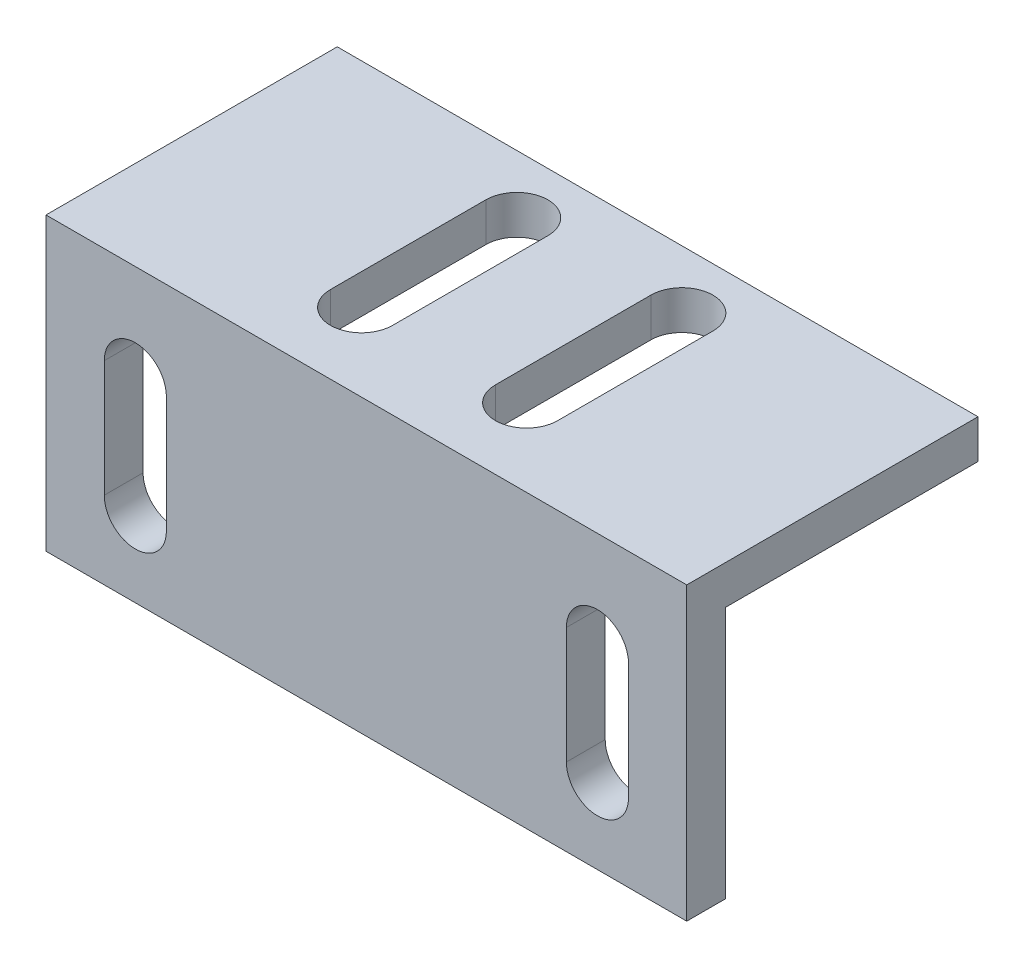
ISO-10303-21;
HEADER;
FILE_DESCRIPTION(('STEP AP214'),'2;1');
FILE_NAME('part.step','',(''),(''),'','','');
FILE_SCHEMA(('AUTOMOTIVE_DESIGN { 1 0 10303 214 1 1 1 1 }'));
ENDSEC;
DATA;
#1=APPLICATION_CONTEXT('core data for automotive mechanical design processes');
#2=APPLICATION_PROTOCOL_DEFINITION('international standard','automotive_design',2000,#1);
#3=PRODUCT_CONTEXT('',#1,'mechanical');
#4=PRODUCT('Part','Part','',(#3));
#5=PRODUCT_RELATED_PRODUCT_CATEGORY('part','',(#4));
#6=PRODUCT_DEFINITION_FORMATION('','',#4);
#7=PRODUCT_DEFINITION_CONTEXT('part definition',#1,'design');
#8=PRODUCT_DEFINITION('design','',#6,#7);
#9=PRODUCT_DEFINITION_SHAPE('','',#8);
#10=(LENGTH_UNIT() NAMED_UNIT(*) SI_UNIT(.MILLI.,.METRE.));
#11=(NAMED_UNIT(*) PLANE_ANGLE_UNIT() SI_UNIT($,.RADIAN.));
#12=(NAMED_UNIT(*) SI_UNIT($,.STERADIAN.) SOLID_ANGLE_UNIT());
#13=UNCERTAINTY_MEASURE_WITH_UNIT(LENGTH_MEASURE(1.E-05),#10,'distance_accuracy_value','');
#14=(GEOMETRIC_REPRESENTATION_CONTEXT(3) GLOBAL_UNCERTAINTY_ASSIGNED_CONTEXT((#13)) GLOBAL_UNIT_ASSIGNED_CONTEXT((#10,
#11,#12)) REPRESENTATION_CONTEXT('',''));
#15=CARTESIAN_POINT('',(0.,0.,0.));
#16=DIRECTION('',(0.,0.,1.));
#17=DIRECTION('',(1.,0.,0.));
#18=AXIS2_PLACEMENT_3D('',#15,#16,#17);
#19=CARTESIAN_POINT('',(33.,0.,-2.));
#20=DIRECTION('',(0.,1.,0.));
#21=DIRECTION('',(0.,0.,1.));
#22=AXIS2_PLACEMENT_3D('',#19,#20,#21);
#23=PLANE('',#22);
#24=DIRECTION('',(0.,0.,-1.));
#25=VECTOR('',#24,1.);
#26=CARTESIAN_POINT('',(0.,0.,-2.));
#27=LINE('',#26,#25);
#28=CARTESIAN_POINT('',(0.,0.,0.));
#29=VERTEX_POINT('',#28);
#30=CARTESIAN_POINT('',(0.,0.,-2.));
#31=VERTEX_POINT('',#30);
#32=EDGE_CURVE('E317',#29,#31,#27,.T.);
#33=ORIENTED_EDGE('',*,*,#32,.T.);
#34=DIRECTION('',(-1.,0.,0.));
#35=VECTOR('',#34,1.);
#36=CARTESIAN_POINT('',(33.,0.,-2.));
#37=LINE('',#36,#35);
#38=CARTESIAN_POINT('',(33.,0.,-2.));
#39=VERTEX_POINT('',#38);
#40=EDGE_CURVE('E11',#39,#31,#37,.T.);
#41=ORIENTED_EDGE('',*,*,#40,.F.);
#42=DIRECTION('',(0.,0.,-1.));
#43=VECTOR('',#42,1.);
#44=CARTESIAN_POINT('',(33.,0.,-2.));
#45=LINE('',#44,#43);
#46=CARTESIAN_POINT('',(33.,0.,0.));
#47=VERTEX_POINT('',#46);
#48=EDGE_CURVE('E318',#47,#39,#45,.T.);
#49=ORIENTED_EDGE('',*,*,#48,.F.);
#50=DIRECTION('',(-1.,0.,0.));
#51=VECTOR('',#50,1.);
#52=CARTESIAN_POINT('',(33.,0.,0.));
#53=LINE('',#52,#51);
#54=EDGE_CURVE('E332',#47,#29,#53,.T.);
#55=ORIENTED_EDGE('',*,*,#54,.T.);
#56=EDGE_LOOP('',(#33,#41,#49,#55));
#57=FACE_BOUND('',#56,.T.);
#58=ADVANCED_FACE('F36',(#57),#23,.F.);
#59=CARTESIAN_POINT('',(33.,13.,-2.));
#60=DIRECTION('',(0.,0.,1.));
#61=DIRECTION('',(0.,-1.,0.));
#62=AXIS2_PLACEMENT_3D('',#59,#60,#61);
#63=PLANE('',#62);
#64=DIRECTION('',(0.,1.,0.));
#65=VECTOR('',#64,1.);
#66=CARTESIAN_POINT('',(30.,13.,-2.));
#67=LINE('',#66,#65);
#68=CARTESIAN_POINT('',(30.,4.,-2.));
#69=VERTEX_POINT('',#68);
#70=CARTESIAN_POINT('',(30.,10.,-2.));
#71=VERTEX_POINT('',#70);
#72=EDGE_CURVE('E279',#69,#71,#67,.T.);
#73=ORIENTED_EDGE('',*,*,#72,.T.);
#74=CARTESIAN_POINT('',(28.4,10.,-2.));
#75=DIRECTION('',(0.,0.,1.));
#76=DIRECTION('',(0.,-1.,0.));
#77=AXIS2_PLACEMENT_3D('',#74,#75,#76);
#78=CIRCLE('',#77,1.6);
#79=CARTESIAN_POINT('',(26.8,10.,-2.));
#80=VERTEX_POINT('',#79);
#81=EDGE_CURVE('E282',#71,#80,#78,.T.);
#82=ORIENTED_EDGE('',*,*,#81,.T.);
#83=DIRECTION('',(0.,-1.,0.));
#84=VECTOR('',#83,1.);
#85=CARTESIAN_POINT('',(26.8,13.,-2.));
#86=LINE('',#85,#84);
#87=CARTESIAN_POINT('',(26.8,4.,-2.));
#88=VERTEX_POINT('',#87);
#89=EDGE_CURVE('E267',#80,#88,#86,.T.);
#90=ORIENTED_EDGE('',*,*,#89,.T.);
#91=CARTESIAN_POINT('',(28.4,4.,-2.));
#92=DIRECTION('',(0.,0.,1.));
#93=DIRECTION('',(0.,-1.,0.));
#94=AXIS2_PLACEMENT_3D('',#91,#92,#93);
#95=CIRCLE('',#94,1.6);
#96=EDGE_CURVE('E276',#88,#69,#95,.T.);
#97=ORIENTED_EDGE('',*,*,#96,.T.);
#98=EDGE_LOOP('',(#73,#82,#90,#97));
#99=FACE_BOUND('',#98,.T.);
#100=DIRECTION('',(0.,1.,0.));
#101=VECTOR('',#100,1.);
#102=CARTESIAN_POINT('',(6.2,13.,-2.));
#103=LINE('',#102,#101);
#104=CARTESIAN_POINT('',(6.2,4.,-2.));
#105=VERTEX_POINT('',#104);
#106=CARTESIAN_POINT('',(6.2,10.,-2.));
#107=VERTEX_POINT('',#106);
#108=EDGE_CURVE('E311',#105,#107,#103,.T.);
#109=ORIENTED_EDGE('',*,*,#108,.T.);
#110=CARTESIAN_POINT('',(4.6,10.,-2.));
#111=DIRECTION('',(0.,0.,1.));
#112=DIRECTION('',(0.,-1.,0.));
#113=AXIS2_PLACEMENT_3D('',#110,#111,#112);
#114=CIRCLE('',#113,1.6);
#115=CARTESIAN_POINT('',(3.,10.,-2.));
#116=VERTEX_POINT('',#115);
#117=EDGE_CURVE('E314',#107,#116,#114,.T.);
#118=ORIENTED_EDGE('',*,*,#117,.T.);
#119=DIRECTION('',(0.,-1.,0.));
#120=VECTOR('',#119,1.);
#121=CARTESIAN_POINT('',(3.,13.,-2.));
#122=LINE('',#121,#120);
#123=CARTESIAN_POINT('',(3.,4.,-2.));
#124=VERTEX_POINT('',#123);
#125=EDGE_CURVE('E299',#116,#124,#122,.T.);
#126=ORIENTED_EDGE('',*,*,#125,.T.);
#127=CARTESIAN_POINT('',(4.6,4.,-2.));
#128=DIRECTION('',(0.,0.,1.));
#129=DIRECTION('',(0.,-1.,0.));
#130=AXIS2_PLACEMENT_3D('',#127,#128,#129);
#131=CIRCLE('',#130,1.6);
#132=EDGE_CURVE('E308',#124,#105,#131,.T.);
#133=ORIENTED_EDGE('',*,*,#132,.T.);
#134=EDGE_LOOP('',(#109,#118,#126,#133));
#135=FACE_BOUND('',#134,.T.);
#136=DIRECTION('',(0.,1.,0.));
#137=VECTOR('',#136,1.);
#138=CARTESIAN_POINT('',(0.,13.,-2.));
#139=LINE('',#138,#137);
#140=CARTESIAN_POINT('',(0.,13.,-2.));
#141=VERTEX_POINT('',#140);
#142=EDGE_CURVE('E335',#31,#141,#139,.T.);
#143=ORIENTED_EDGE('',*,*,#142,.T.);
#144=DIRECTION('',(-1.,0.,0.));
#145=VECTOR('',#144,1.);
#146=CARTESIAN_POINT('',(33.,13.,-2.));
#147=LINE('',#146,#145);
#148=CARTESIAN_POINT('',(33.,13.,-2.));
#149=VERTEX_POINT('',#148);
#150=EDGE_CURVE('E43',#149,#141,#147,.T.);
#151=ORIENTED_EDGE('',*,*,#150,.F.);
#152=DIRECTION('',(0.,1.,0.));
#153=VECTOR('',#152,1.);
#154=CARTESIAN_POINT('',(33.,13.,-2.));
#155=LINE('',#154,#153);
#156=EDGE_CURVE('E321',#39,#149,#155,.T.);
#157=ORIENTED_EDGE('',*,*,#156,.F.);
#158=ORIENTED_EDGE('',*,*,#40,.T.);
#159=EDGE_LOOP('',(#143,#151,#157,#158));
#160=FACE_BOUND('',#159,.T.);
#161=ADVANCED_FACE('F381',(#99,#135,#160),#63,.F.);
#162=CARTESIAN_POINT('',(33.,13.,-15.));
#163=DIRECTION('',(0.,1.,0.));
#164=DIRECTION('',(0.,0.,1.));
#165=AXIS2_PLACEMENT_3D('',#162,#163,#164);
#166=PLANE('',#165);
#167=DIRECTION('',(0.,0.,-1.));
#168=VECTOR('',#167,1.);
#169=CARTESIAN_POINT('',(22.35,13.,-15.));
#170=LINE('',#169,#168);
#171=CARTESIAN_POINT('',(22.35,13.,-4.));
#172=VERTEX_POINT('',#171);
#173=CARTESIAN_POINT('',(22.35,13.,-12.));
#174=VERTEX_POINT('',#173);
#175=EDGE_CURVE('E215',#172,#174,#170,.T.);
#176=ORIENTED_EDGE('',*,*,#175,.T.);
#177=CARTESIAN_POINT('',(20.75,13.,-12.));
#178=DIRECTION('',(0.,1.,0.));
#179=DIRECTION('',(0.,0.,1.));
#180=AXIS2_PLACEMENT_3D('',#177,#178,#179);
#181=CIRCLE('',#180,1.6);
#182=CARTESIAN_POINT('',(19.15,13.,-12.));
#183=VERTEX_POINT('',#182);
#184=EDGE_CURVE('E218',#174,#183,#181,.T.);
#185=ORIENTED_EDGE('',*,*,#184,.T.);
#186=DIRECTION('',(0.,0.,1.));
#187=VECTOR('',#186,1.);
#188=CARTESIAN_POINT('',(19.15,13.,-15.));
#189=LINE('',#188,#187);
#190=CARTESIAN_POINT('',(19.15,13.,-4.));
#191=VERTEX_POINT('',#190);
#192=EDGE_CURVE('E210',#183,#191,#189,.T.);
#193=ORIENTED_EDGE('',*,*,#192,.T.);
#194=CARTESIAN_POINT('',(20.75,13.,-4.));
#195=DIRECTION('',(0.,1.,0.));
#196=DIRECTION('',(0.,0.,1.));
#197=AXIS2_PLACEMENT_3D('',#194,#195,#196);
#198=CIRCLE('',#197,1.6);
#199=EDGE_CURVE('E190',#191,#172,#198,.T.);
#200=ORIENTED_EDGE('',*,*,#199,.T.);
#201=EDGE_LOOP('',(#176,#185,#193,#200));
#202=FACE_BOUND('',#201,.T.);
#203=DIRECTION('',(0.,0.,-1.));
#204=VECTOR('',#203,1.);
#205=CARTESIAN_POINT('',(13.85,13.,-15.));
#206=LINE('',#205,#204);
#207=CARTESIAN_POINT('',(13.85,13.,-4.));
#208=VERTEX_POINT('',#207);
#209=CARTESIAN_POINT('',(13.85,13.,-12.));
#210=VERTEX_POINT('',#209);
#211=EDGE_CURVE('E247',#208,#210,#206,.T.);
#212=ORIENTED_EDGE('',*,*,#211,.T.);
#213=CARTESIAN_POINT('',(12.25,13.,-12.));
#214=DIRECTION('',(0.,1.,0.));
#215=DIRECTION('',(0.,0.,1.));
#216=AXIS2_PLACEMENT_3D('',#213,#214,#215);
#217=CIRCLE('',#216,1.6);
#218=CARTESIAN_POINT('',(10.65,13.,-12.));
#219=VERTEX_POINT('',#218);
#220=EDGE_CURVE('E250',#210,#219,#217,.T.);
#221=ORIENTED_EDGE('',*,*,#220,.T.);
#222=DIRECTION('',(0.,0.,1.));
#223=VECTOR('',#222,1.);
#224=CARTESIAN_POINT('',(10.65,13.,-15.));
#225=LINE('',#224,#223);
#226=CARTESIAN_POINT('',(10.65,13.,-4.));
#227=VERTEX_POINT('',#226);
#228=EDGE_CURVE('E235',#219,#227,#225,.T.);
#229=ORIENTED_EDGE('',*,*,#228,.T.);
#230=CARTESIAN_POINT('',(12.25,13.,-4.));
#231=DIRECTION('',(0.,1.,0.));
#232=DIRECTION('',(0.,0.,1.));
#233=AXIS2_PLACEMENT_3D('',#230,#231,#232);
#234=CIRCLE('',#233,1.6);
#235=EDGE_CURVE('E244',#227,#208,#234,.T.);
#236=ORIENTED_EDGE('',*,*,#235,.T.);
#237=EDGE_LOOP('',(#212,#221,#229,#236));
#238=FACE_BOUND('',#237,.T.);
#239=DIRECTION('',(0.,0.,-1.));
#240=VECTOR('',#239,1.);
#241=CARTESIAN_POINT('',(0.,13.,-15.));
#242=LINE('',#241,#240);
#243=CARTESIAN_POINT('',(0.,13.,-15.));
#244=VERTEX_POINT('',#243);
#245=EDGE_CURVE('E337',#141,#244,#242,.T.);
#246=ORIENTED_EDGE('',*,*,#245,.T.);
#247=DIRECTION('',(-1.,0.,0.));
#248=VECTOR('',#247,1.);
#249=CARTESIAN_POINT('',(33.,13.,-15.));
#250=LINE('',#249,#248);
#251=CARTESIAN_POINT('',(33.,13.,-15.));
#252=VERTEX_POINT('',#251);
#253=EDGE_CURVE('E352',#252,#244,#250,.T.);
#254=ORIENTED_EDGE('',*,*,#253,.F.);
#255=DIRECTION('',(0.,0.,-1.));
#256=VECTOR('',#255,1.);
#257=CARTESIAN_POINT('',(33.,13.,-15.));
#258=LINE('',#257,#256);
#259=EDGE_CURVE('E324',#149,#252,#258,.T.);
#260=ORIENTED_EDGE('',*,*,#259,.F.);
#261=ORIENTED_EDGE('',*,*,#150,.T.);
#262=EDGE_LOOP('',(#246,#254,#260,#261));
#263=FACE_BOUND('',#262,.T.);
#264=ADVANCED_FACE('F359',(#202,#238,#263),#166,.F.);
#265=CARTESIAN_POINT('',(33.,15.,-15.));
#266=DIRECTION('',(0.,0.,1.));
#267=DIRECTION('',(1.,0.,0.));
#268=AXIS2_PLACEMENT_3D('',#265,#266,#267);
#269=PLANE('',#268);
#270=DIRECTION('',(0.,1.,0.));
#271=VECTOR('',#270,1.);
#272=CARTESIAN_POINT('',(0.,15.,-15.));
#273=LINE('',#272,#271);
#274=CARTESIAN_POINT('',(0.,15.,-15.));
#275=VERTEX_POINT('',#274);
#276=EDGE_CURVE('E339',#244,#275,#273,.T.);
#277=ORIENTED_EDGE('',*,*,#276,.T.);
#278=DIRECTION('',(-1.,0.,0.));
#279=VECTOR('',#278,1.);
#280=CARTESIAN_POINT('',(33.,15.,-15.));
#281=LINE('',#280,#279);
#282=CARTESIAN_POINT('',(33.,15.,-15.));
#283=VERTEX_POINT('',#282);
#284=EDGE_CURVE('E349',#283,#275,#281,.T.);
#285=ORIENTED_EDGE('',*,*,#284,.F.);
#286=DIRECTION('',(0.,1.,0.));
#287=VECTOR('',#286,1.);
#288=CARTESIAN_POINT('',(33.,15.,-15.));
#289=LINE('',#288,#287);
#290=EDGE_CURVE('E326',#252,#283,#289,.T.);
#291=ORIENTED_EDGE('',*,*,#290,.F.);
#292=ORIENTED_EDGE('',*,*,#253,.T.);
#293=EDGE_LOOP('',(#277,#285,#291,#292));
#294=FACE_BOUND('',#293,.T.);
#295=ADVANCED_FACE('F370',(#294),#269,.F.);
#296=CARTESIAN_POINT('',(33.,15.,0.));
#297=DIRECTION('',(0.,-1.,0.));
#298=DIRECTION('',(0.,0.,-1.));
#299=AXIS2_PLACEMENT_3D('',#296,#297,#298);
#300=PLANE('',#299);
#301=DIRECTION('',(0.,0.,1.));
#302=VECTOR('',#301,1.);
#303=CARTESIAN_POINT('',(19.15,15.,-12.));
#304=LINE('',#303,#302);
#305=CARTESIAN_POINT('',(19.15,15.,-12.));
#306=VERTEX_POINT('',#305);
#307=CARTESIAN_POINT('',(19.15,15.,-4.));
#308=VERTEX_POINT('',#307);
#309=EDGE_CURVE('E196',#306,#308,#304,.T.);
#310=ORIENTED_EDGE('',*,*,#309,.F.);
#311=CARTESIAN_POINT('',(20.75,15.,-12.));
#312=DIRECTION('',(0.,1.,0.));
#313=DIRECTION('',(0.,0.,1.));
#314=AXIS2_PLACEMENT_3D('',#311,#312,#313);
#315=CIRCLE('',#314,1.6);
#316=CARTESIAN_POINT('',(22.35,15.,-12.));
#317=VERTEX_POINT('',#316);
#318=EDGE_CURVE('E58',#317,#306,#315,.T.);
#319=ORIENTED_EDGE('',*,*,#318,.F.);
#320=DIRECTION('',(0.,0.,-1.));
#321=VECTOR('',#320,1.);
#322=CARTESIAN_POINT('',(22.35,15.,-12.));
#323=LINE('',#322,#321);
#324=CARTESIAN_POINT('',(22.35,15.,-4.));
#325=VERTEX_POINT('',#324);
#326=EDGE_CURVE('E203',#325,#317,#323,.T.);
#327=ORIENTED_EDGE('',*,*,#326,.F.);
#328=CARTESIAN_POINT('',(20.75,15.,-4.));
#329=DIRECTION('',(0.,1.,0.));
#330=DIRECTION('',(0.,0.,1.));
#331=AXIS2_PLACEMENT_3D('',#328,#329,#330);
#332=CIRCLE('',#331,1.6);
#333=EDGE_CURVE('E187',#308,#325,#332,.T.);
#334=ORIENTED_EDGE('',*,*,#333,.F.);
#335=EDGE_LOOP('',(#310,#319,#327,#334));
#336=FACE_BOUND('',#335,.T.);
#337=DIRECTION('',(0.,0.,1.));
#338=VECTOR('',#337,1.);
#339=CARTESIAN_POINT('',(10.65,15.,-12.));
#340=LINE('',#339,#338);
#341=CARTESIAN_POINT('',(10.65,15.,-12.));
#342=VERTEX_POINT('',#341);
#343=CARTESIAN_POINT('',(10.65,15.,-4.));
#344=VERTEX_POINT('',#343);
#345=EDGE_CURVE('E223',#342,#344,#340,.T.);
#346=ORIENTED_EDGE('',*,*,#345,.F.);
#347=CARTESIAN_POINT('',(12.25,15.,-12.));
#348=DIRECTION('',(0.,1.,0.));
#349=DIRECTION('',(0.,0.,1.));
#350=AXIS2_PLACEMENT_3D('',#347,#348,#349);
#351=CIRCLE('',#350,1.6);
#352=CARTESIAN_POINT('',(13.85,15.,-12.));
#353=VERTEX_POINT('',#352);
#354=EDGE_CURVE('E221',#353,#342,#351,.T.);
#355=ORIENTED_EDGE('',*,*,#354,.F.);
#356=DIRECTION('',(0.,0.,-1.));
#357=VECTOR('',#356,1.);
#358=CARTESIAN_POINT('',(13.85,15.,-12.));
#359=LINE('',#358,#357);
#360=CARTESIAN_POINT('',(13.85,15.,-4.));
#361=VERTEX_POINT('',#360);
#362=EDGE_CURVE('E229',#361,#353,#359,.T.);
#363=ORIENTED_EDGE('',*,*,#362,.F.);
#364=CARTESIAN_POINT('',(12.25,15.,-4.));
#365=DIRECTION('',(0.,1.,0.));
#366=DIRECTION('',(0.,0.,1.));
#367=AXIS2_PLACEMENT_3D('',#364,#365,#366);
#368=CIRCLE('',#367,1.6);
#369=EDGE_CURVE('E226',#344,#361,#368,.T.);
#370=ORIENTED_EDGE('',*,*,#369,.F.);
#371=EDGE_LOOP('',(#346,#355,#363,#370));
#372=FACE_BOUND('',#371,.T.);
#373=DIRECTION('',(0.,0.,1.));
#374=VECTOR('',#373,1.);
#375=CARTESIAN_POINT('',(0.,15.,0.));
#376=LINE('',#375,#374);
#377=CARTESIAN_POINT('',(0.,15.,0.));
#378=VERTEX_POINT('',#377);
#379=EDGE_CURVE('E341',#275,#378,#376,.T.);
#380=ORIENTED_EDGE('',*,*,#379,.T.);
#381=DIRECTION('',(-1.,0.,0.));
#382=VECTOR('',#381,1.);
#383=CARTESIAN_POINT('',(33.,15.,0.));
#384=LINE('',#383,#382);
#385=CARTESIAN_POINT('',(33.,15.,0.));
#386=VERTEX_POINT('',#385);
#387=EDGE_CURVE('E346',#386,#378,#384,.T.);
#388=ORIENTED_EDGE('',*,*,#387,.F.);
#389=DIRECTION('',(0.,0.,1.));
#390=VECTOR('',#389,1.);
#391=CARTESIAN_POINT('',(33.,15.,0.));
#392=LINE('',#391,#390);
#393=EDGE_CURVE('E328',#283,#386,#392,.T.);
#394=ORIENTED_EDGE('',*,*,#393,.F.);
#395=ORIENTED_EDGE('',*,*,#284,.T.);
#396=EDGE_LOOP('',(#380,#388,#394,#395));
#397=FACE_BOUND('',#396,.T.);
#398=ADVANCED_FACE('F200',(#336,#372,#397),#300,.F.);
#399=CARTESIAN_POINT('',(33.,0.,0.));
#400=DIRECTION('',(0.,0.,-1.));
#401=DIRECTION('',(-1.,0.,0.));
#402=AXIS2_PLACEMENT_3D('',#399,#400,#401);
#403=PLANE('',#402);
#404=DIRECTION('',(0.,-1.,0.));
#405=VECTOR('',#404,1.);
#406=CARTESIAN_POINT('',(26.8,10.,0.));
#407=LINE('',#406,#405);
#408=CARTESIAN_POINT('',(26.8,10.,0.));
#409=VERTEX_POINT('',#408);
#410=CARTESIAN_POINT('',(26.8,4.,0.));
#411=VERTEX_POINT('',#410);
#412=EDGE_CURVE('E255',#409,#411,#407,.T.);
#413=ORIENTED_EDGE('',*,*,#412,.F.);
#414=CARTESIAN_POINT('',(28.4,10.,0.));
#415=DIRECTION('',(0.,0.,1.));
#416=DIRECTION('',(1.,0.,0.));
#417=AXIS2_PLACEMENT_3D('',#414,#415,#416);
#418=CIRCLE('',#417,1.6);
#419=CARTESIAN_POINT('',(30.,10.,0.));
#420=VERTEX_POINT('',#419);
#421=EDGE_CURVE('E253',#420,#409,#418,.T.);
#422=ORIENTED_EDGE('',*,*,#421,.F.);
#423=DIRECTION('',(0.,1.,0.));
#424=VECTOR('',#423,1.);
#425=CARTESIAN_POINT('',(30.,10.,0.));
#426=LINE('',#425,#424);
#427=CARTESIAN_POINT('',(30.,4.,0.));
#428=VERTEX_POINT('',#427);
#429=EDGE_CURVE('E261',#428,#420,#426,.T.);
#430=ORIENTED_EDGE('',*,*,#429,.F.);
#431=CARTESIAN_POINT('',(28.4,4.,0.));
#432=DIRECTION('',(0.,0.,1.));
#433=DIRECTION('',(1.,0.,0.));
#434=AXIS2_PLACEMENT_3D('',#431,#432,#433);
#435=CIRCLE('',#434,1.6);
#436=EDGE_CURVE('E258',#411,#428,#435,.T.);
#437=ORIENTED_EDGE('',*,*,#436,.F.);
#438=EDGE_LOOP('',(#413,#422,#430,#437));
#439=FACE_BOUND('',#438,.T.);
#440=DIRECTION('',(0.,-1.,0.));
#441=VECTOR('',#440,1.);
#442=CARTESIAN_POINT('',(3.,10.,0.));
#443=LINE('',#442,#441);
#444=CARTESIAN_POINT('',(3.,10.,0.));
#445=VERTEX_POINT('',#444);
#446=CARTESIAN_POINT('',(3.,4.,0.));
#447=VERTEX_POINT('',#446);
#448=EDGE_CURVE('E287',#445,#447,#443,.T.);
#449=ORIENTED_EDGE('',*,*,#448,.F.);
#450=CARTESIAN_POINT('',(4.6,10.,0.));
#451=DIRECTION('',(0.,0.,1.));
#452=DIRECTION('',(1.,0.,0.));
#453=AXIS2_PLACEMENT_3D('',#450,#451,#452);
#454=CIRCLE('',#453,1.6);
#455=CARTESIAN_POINT('',(6.2,10.,0.));
#456=VERTEX_POINT('',#455);
#457=EDGE_CURVE('E285',#456,#445,#454,.T.);
#458=ORIENTED_EDGE('',*,*,#457,.F.);
#459=DIRECTION('',(0.,1.,0.));
#460=VECTOR('',#459,1.);
#461=CARTESIAN_POINT('',(6.2,10.,0.));
#462=LINE('',#461,#460);
#463=CARTESIAN_POINT('',(6.2,4.,0.));
#464=VERTEX_POINT('',#463);
#465=EDGE_CURVE('E293',#464,#456,#462,.T.);
#466=ORIENTED_EDGE('',*,*,#465,.F.);
#467=CARTESIAN_POINT('',(4.6,4.,0.));
#468=DIRECTION('',(0.,0.,1.));
#469=DIRECTION('',(1.,0.,0.));
#470=AXIS2_PLACEMENT_3D('',#467,#468,#469);
#471=CIRCLE('',#470,1.6);
#472=EDGE_CURVE('E290',#447,#464,#471,.T.);
#473=ORIENTED_EDGE('',*,*,#472,.F.);
#474=EDGE_LOOP('',(#449,#458,#466,#473));
#475=FACE_BOUND('',#474,.T.);
#476=DIRECTION('',(0.,-1.,0.));
#477=VECTOR('',#476,1.);
#478=CARTESIAN_POINT('',(0.,0.,0.));
#479=LINE('',#478,#477);
#480=EDGE_CURVE('E322',#378,#29,#479,.T.);
#481=ORIENTED_EDGE('',*,*,#480,.T.);
#482=ORIENTED_EDGE('',*,*,#54,.F.);
#483=DIRECTION('',(0.,-1.,0.));
#484=VECTOR('',#483,1.);
#485=CARTESIAN_POINT('',(33.,0.,0.));
#486=LINE('',#485,#484);
#487=EDGE_CURVE('E330',#386,#47,#486,.T.);
#488=ORIENTED_EDGE('',*,*,#487,.F.);
#489=ORIENTED_EDGE('',*,*,#387,.T.);
#490=EDGE_LOOP('',(#481,#482,#488,#489));
#491=FACE_BOUND('',#490,.T.);
#492=ADVANCED_FACE('F384',(#439,#475,#491),#403,.F.);
#493=CARTESIAN_POINT('',(33.,0.,0.));
#494=DIRECTION('',(-1.,0.,0.));
#495=DIRECTION('',(0.,0.,1.));
#496=AXIS2_PLACEMENT_3D('',#493,#494,#495);
#497=PLANE('',#496);
#498=ORIENTED_EDGE('',*,*,#48,.T.);
#499=ORIENTED_EDGE('',*,*,#156,.T.);
#500=ORIENTED_EDGE('',*,*,#259,.T.);
#501=ORIENTED_EDGE('',*,*,#290,.T.);
#502=ORIENTED_EDGE('',*,*,#393,.T.);
#503=ORIENTED_EDGE('',*,*,#487,.T.);
#504=EDGE_LOOP('',(#498,#499,#500,#501,#502,#503));
#505=FACE_BOUND('',#504,.T.);
#506=ADVANCED_FACE('F377',(#505),#497,.F.);
#507=CARTESIAN_POINT('',(0.,0.,0.));
#508=DIRECTION('',(-1.,0.,0.));
#509=DIRECTION('',(0.,0.,1.));
#510=AXIS2_PLACEMENT_3D('',#507,#508,#509);
#511=PLANE('',#510);
#512=ORIENTED_EDGE('',*,*,#32,.F.);
#513=ORIENTED_EDGE('',*,*,#480,.F.);
#514=ORIENTED_EDGE('',*,*,#379,.F.);
#515=ORIENTED_EDGE('',*,*,#276,.F.);
#516=ORIENTED_EDGE('',*,*,#245,.F.);
#517=ORIENTED_EDGE('',*,*,#142,.F.);
#518=EDGE_LOOP('',(#512,#513,#514,#515,#516,#517));
#519=FACE_BOUND('',#518,.T.);
#520=ADVANCED_FACE('F365',(#519),#511,.T.);
#521=CARTESIAN_POINT('',(4.6,10.,-15.));
#522=DIRECTION('',(0.,0.,1.));
#523=DIRECTION('',(1.,0.,0.));
#524=AXIS2_PLACEMENT_3D('',#521,#522,#523);
#525=CYLINDRICAL_SURFACE('',#524,1.6);
#526=DIRECTION('',(0.,0.,1.));
#527=VECTOR('',#526,1.);
#528=CARTESIAN_POINT('',(6.2,10.,-15.));
#529=LINE('',#528,#527);
#530=EDGE_CURVE('E297',#107,#456,#529,.T.);
#531=ORIENTED_EDGE('',*,*,#530,.T.);
#532=ORIENTED_EDGE('',*,*,#457,.T.);
#533=DIRECTION('',(0.,0.,1.));
#534=VECTOR('',#533,1.);
#535=CARTESIAN_POINT('',(3.,10.,-15.));
#536=LINE('',#535,#534);
#537=EDGE_CURVE('E296',#116,#445,#536,.T.);
#538=ORIENTED_EDGE('',*,*,#537,.F.);
#539=ORIENTED_EDGE('',*,*,#117,.F.);
#540=EDGE_LOOP('',(#531,#532,#538,#539));
#541=FACE_BOUND('',#540,.T.);
#542=ADVANCED_FACE('F525',(#541),#525,.F.);
#543=CARTESIAN_POINT('',(6.2,10.,-15.));
#544=DIRECTION('',(1.,0.,0.));
#545=DIRECTION('',(0.,1.,0.));
#546=AXIS2_PLACEMENT_3D('',#543,#544,#545);
#547=PLANE('',#546);
#548=DIRECTION('',(0.,0.,1.));
#549=VECTOR('',#548,1.);
#550=CARTESIAN_POINT('',(6.2,4.,-15.));
#551=LINE('',#550,#549);
#552=EDGE_CURVE('E300',#105,#464,#551,.T.);
#553=ORIENTED_EDGE('',*,*,#552,.T.);
#554=ORIENTED_EDGE('',*,*,#465,.T.);
#555=ORIENTED_EDGE('',*,*,#530,.F.);
#556=ORIENTED_EDGE('',*,*,#108,.F.);
#557=EDGE_LOOP('',(#553,#554,#555,#556));
#558=FACE_BOUND('',#557,.T.);
#559=ADVANCED_FACE('F521',(#558),#547,.F.);
#560=CARTESIAN_POINT('',(4.6,4.,-15.));
#561=DIRECTION('',(0.,0.,1.));
#562=DIRECTION('',(1.,0.,0.));
#563=AXIS2_PLACEMENT_3D('',#560,#561,#562);
#564=CYLINDRICAL_SURFACE('',#563,1.6);
#565=DIRECTION('',(0.,0.,1.));
#566=VECTOR('',#565,1.);
#567=CARTESIAN_POINT('',(3.,4.,-15.));
#568=LINE('',#567,#566);
#569=EDGE_CURVE('E302',#124,#447,#568,.T.);
#570=ORIENTED_EDGE('',*,*,#569,.T.);
#571=ORIENTED_EDGE('',*,*,#472,.T.);
#572=ORIENTED_EDGE('',*,*,#552,.F.);
#573=ORIENTED_EDGE('',*,*,#132,.F.);
#574=EDGE_LOOP('',(#570,#571,#572,#573));
#575=FACE_BOUND('',#574,.T.);
#576=ADVANCED_FACE('F524',(#575),#564,.F.);
#577=CARTESIAN_POINT('',(3.,10.,-15.));
#578=DIRECTION('',(-1.,0.,0.));
#579=DIRECTION('',(0.,0.,1.));
#580=AXIS2_PLACEMENT_3D('',#577,#578,#579);
#581=PLANE('',#580);
#582=ORIENTED_EDGE('',*,*,#537,.T.);
#583=ORIENTED_EDGE('',*,*,#448,.T.);
#584=ORIENTED_EDGE('',*,*,#569,.F.);
#585=ORIENTED_EDGE('',*,*,#125,.F.);
#586=EDGE_LOOP('',(#582,#583,#584,#585));
#587=FACE_BOUND('',#586,.T.);
#588=ADVANCED_FACE('F519',(#587),#581,.F.);
#589=CARTESIAN_POINT('',(28.4,10.,-15.));
#590=DIRECTION('',(0.,0.,1.));
#591=DIRECTION('',(1.,0.,0.));
#592=AXIS2_PLACEMENT_3D('',#589,#590,#591);
#593=CYLINDRICAL_SURFACE('',#592,1.6);
#594=DIRECTION('',(0.,0.,1.));
#595=VECTOR('',#594,1.);
#596=CARTESIAN_POINT('',(30.,10.,-15.));
#597=LINE('',#596,#595);
#598=EDGE_CURVE('E265',#71,#420,#597,.T.);
#599=ORIENTED_EDGE('',*,*,#598,.T.);
#600=ORIENTED_EDGE('',*,*,#421,.T.);
#601=DIRECTION('',(0.,0.,1.));
#602=VECTOR('',#601,1.);
#603=CARTESIAN_POINT('',(26.8,10.,-15.));
#604=LINE('',#603,#602);
#605=EDGE_CURVE('E264',#80,#409,#604,.T.);
#606=ORIENTED_EDGE('',*,*,#605,.F.);
#607=ORIENTED_EDGE('',*,*,#81,.F.);
#608=EDGE_LOOP('',(#599,#600,#606,#607));
#609=FACE_BOUND('',#608,.T.);
#610=ADVANCED_FACE('F510',(#609),#593,.F.);
#611=CARTESIAN_POINT('',(30.,10.,-15.));
#612=DIRECTION('',(1.,0.,0.));
#613=DIRECTION('',(0.,0.,-1.));
#614=AXIS2_PLACEMENT_3D('',#611,#612,#613);
#615=PLANE('',#614);
#616=DIRECTION('',(0.,0.,1.));
#617=VECTOR('',#616,1.);
#618=CARTESIAN_POINT('',(30.,4.,-15.));
#619=LINE('',#618,#617);
#620=EDGE_CURVE('E268',#69,#428,#619,.T.);
#621=ORIENTED_EDGE('',*,*,#620,.T.);
#622=ORIENTED_EDGE('',*,*,#429,.T.);
#623=ORIENTED_EDGE('',*,*,#598,.F.);
#624=ORIENTED_EDGE('',*,*,#72,.F.);
#625=EDGE_LOOP('',(#621,#622,#623,#624));
#626=FACE_BOUND('',#625,.T.);
#627=ADVANCED_FACE('F506',(#626),#615,.F.);
#628=CARTESIAN_POINT('',(28.4,4.,-15.));
#629=DIRECTION('',(0.,0.,1.));
#630=DIRECTION('',(1.,0.,0.));
#631=AXIS2_PLACEMENT_3D('',#628,#629,#630);
#632=CYLINDRICAL_SURFACE('',#631,1.6);
#633=DIRECTION('',(0.,0.,1.));
#634=VECTOR('',#633,1.);
#635=CARTESIAN_POINT('',(26.8,4.,-15.));
#636=LINE('',#635,#634);
#637=EDGE_CURVE('E270',#88,#411,#636,.T.);
#638=ORIENTED_EDGE('',*,*,#637,.T.);
#639=ORIENTED_EDGE('',*,*,#436,.T.);
#640=ORIENTED_EDGE('',*,*,#620,.F.);
#641=ORIENTED_EDGE('',*,*,#96,.F.);
#642=EDGE_LOOP('',(#638,#639,#640,#641));
#643=FACE_BOUND('',#642,.T.);
#644=ADVANCED_FACE('F509',(#643),#632,.F.);
#645=CARTESIAN_POINT('',(26.8,10.,-15.));
#646=DIRECTION('',(-1.,0.,0.));
#647=DIRECTION('',(0.,0.,1.));
#648=AXIS2_PLACEMENT_3D('',#645,#646,#647);
#649=PLANE('',#648);
#650=ORIENTED_EDGE('',*,*,#605,.T.);
#651=ORIENTED_EDGE('',*,*,#412,.T.);
#652=ORIENTED_EDGE('',*,*,#637,.F.);
#653=ORIENTED_EDGE('',*,*,#89,.F.);
#654=EDGE_LOOP('',(#650,#651,#652,#653));
#655=FACE_BOUND('',#654,.T.);
#656=ADVANCED_FACE('F434',(#655),#649,.F.);
#657=CARTESIAN_POINT('',(12.25,0.,-12.));
#658=DIRECTION('',(0.,1.,0.));
#659=DIRECTION('',(0.,0.,1.));
#660=AXIS2_PLACEMENT_3D('',#657,#658,#659);
#661=CYLINDRICAL_SURFACE('',#660,1.6);
#662=DIRECTION('',(0.,1.,0.));
#663=VECTOR('',#662,1.);
#664=CARTESIAN_POINT('',(13.85,0.,-12.));
#665=LINE('',#664,#663);
#666=EDGE_CURVE('E233',#210,#353,#665,.T.);
#667=ORIENTED_EDGE('',*,*,#666,.T.);
#668=ORIENTED_EDGE('',*,*,#354,.T.);
#669=DIRECTION('',(0.,1.,0.));
#670=VECTOR('',#669,1.);
#671=CARTESIAN_POINT('',(10.65,0.,-12.));
#672=LINE('',#671,#670);
#673=EDGE_CURVE('E232',#219,#342,#672,.T.);
#674=ORIENTED_EDGE('',*,*,#673,.F.);
#675=ORIENTED_EDGE('',*,*,#220,.F.);
#676=EDGE_LOOP('',(#667,#668,#674,#675));
#677=FACE_BOUND('',#676,.T.);
#678=ADVANCED_FACE('F428',(#677),#661,.F.);
#679=CARTESIAN_POINT('',(13.85,0.,-12.));
#680=DIRECTION('',(1.,0.,0.));
#681=DIRECTION('',(0.,0.,-1.));
#682=AXIS2_PLACEMENT_3D('',#679,#680,#681);
#683=PLANE('',#682);
#684=DIRECTION('',(0.,1.,0.));
#685=VECTOR('',#684,1.);
#686=CARTESIAN_POINT('',(13.85,0.,-4.));
#687=LINE('',#686,#685);
#688=EDGE_CURVE('E236',#208,#361,#687,.T.);
#689=ORIENTED_EDGE('',*,*,#688,.T.);
#690=ORIENTED_EDGE('',*,*,#362,.T.);
#691=ORIENTED_EDGE('',*,*,#666,.F.);
#692=ORIENTED_EDGE('',*,*,#211,.F.);
#693=EDGE_LOOP('',(#689,#690,#691,#692));
#694=FACE_BOUND('',#693,.T.);
#695=ADVANCED_FACE('F433',(#694),#683,.F.);
#696=CARTESIAN_POINT('',(12.25,0.,-4.));
#697=DIRECTION('',(0.,1.,0.));
#698=DIRECTION('',(0.,0.,1.));
#699=AXIS2_PLACEMENT_3D('',#696,#697,#698);
#700=CYLINDRICAL_SURFACE('',#699,1.6);
#701=DIRECTION('',(0.,1.,0.));
#702=VECTOR('',#701,1.);
#703=CARTESIAN_POINT('',(10.65,0.,-4.));
#704=LINE('',#703,#702);
#705=EDGE_CURVE('E238',#227,#344,#704,.T.);
#706=ORIENTED_EDGE('',*,*,#705,.T.);
#707=ORIENTED_EDGE('',*,*,#369,.T.);
#708=ORIENTED_EDGE('',*,*,#688,.F.);
#709=ORIENTED_EDGE('',*,*,#235,.F.);
#710=EDGE_LOOP('',(#706,#707,#708,#709));
#711=FACE_BOUND('',#710,.T.);
#712=ADVANCED_FACE('F446',(#711),#700,.F.);
#713=CARTESIAN_POINT('',(10.65,0.,-12.));
#714=DIRECTION('',(-1.,0.,0.));
#715=DIRECTION('',(0.,0.,1.));
#716=AXIS2_PLACEMENT_3D('',#713,#714,#715);
#717=PLANE('',#716);
#718=ORIENTED_EDGE('',*,*,#673,.T.);
#719=ORIENTED_EDGE('',*,*,#345,.T.);
#720=ORIENTED_EDGE('',*,*,#705,.F.);
#721=ORIENTED_EDGE('',*,*,#228,.F.);
#722=EDGE_LOOP('',(#718,#719,#720,#721));
#723=FACE_BOUND('',#722,.T.);
#724=ADVANCED_FACE('F456',(#723),#717,.F.);
#725=CARTESIAN_POINT('',(20.75,0.,-12.));
#726=DIRECTION('',(0.,1.,0.));
#727=DIRECTION('',(0.,0.,1.));
#728=AXIS2_PLACEMENT_3D('',#725,#726,#727);
#729=CYLINDRICAL_SURFACE('',#728,1.6);
#730=DIRECTION('',(0.,1.,0.));
#731=VECTOR('',#730,1.);
#732=CARTESIAN_POINT('',(22.35,0.,-12.));
#733=LINE('',#732,#731);
#734=EDGE_CURVE('E208',#174,#317,#733,.T.);
#735=ORIENTED_EDGE('',*,*,#734,.T.);
#736=ORIENTED_EDGE('',*,*,#318,.T.);
#737=DIRECTION('',(0.,1.,0.));
#738=VECTOR('',#737,1.);
#739=CARTESIAN_POINT('',(19.15,0.,-12.));
#740=LINE('',#739,#738);
#741=EDGE_CURVE('E193',#183,#306,#740,.T.);
#742=ORIENTED_EDGE('',*,*,#741,.F.);
#743=ORIENTED_EDGE('',*,*,#184,.F.);
#744=EDGE_LOOP('',(#735,#736,#742,#743));
#745=FACE_BOUND('',#744,.T.);
#746=ADVANCED_FACE('F466',(#745),#729,.F.);
#747=CARTESIAN_POINT('',(22.35,0.,-12.));
#748=DIRECTION('',(1.,0.,0.));
#749=DIRECTION('',(0.,0.,-1.));
#750=AXIS2_PLACEMENT_3D('',#747,#748,#749);
#751=PLANE('',#750);
#752=DIRECTION('',(0.,1.,0.));
#753=VECTOR('',#752,1.);
#754=CARTESIAN_POINT('',(22.35,0.,-4.));
#755=LINE('',#754,#753);
#756=EDGE_CURVE('E192',#172,#325,#755,.T.);
#757=ORIENTED_EDGE('',*,*,#756,.T.);
#758=ORIENTED_EDGE('',*,*,#326,.T.);
#759=ORIENTED_EDGE('',*,*,#734,.F.);
#760=ORIENTED_EDGE('',*,*,#175,.F.);
#761=EDGE_LOOP('',(#757,#758,#759,#760));
#762=FACE_BOUND('',#761,.T.);
#763=ADVANCED_FACE('F476',(#762),#751,.F.);
#764=CARTESIAN_POINT('',(20.75,0.,-4.));
#765=DIRECTION('',(0.,1.,0.));
#766=DIRECTION('',(0.,0.,1.));
#767=AXIS2_PLACEMENT_3D('',#764,#765,#766);
#768=CYLINDRICAL_SURFACE('',#767,1.6);
#769=DIRECTION('',(0.,1.,0.));
#770=VECTOR('',#769,1.);
#771=CARTESIAN_POINT('',(19.15,0.,-4.));
#772=LINE('',#771,#770);
#773=EDGE_CURVE('E50',#191,#308,#772,.T.);
#774=ORIENTED_EDGE('',*,*,#773,.T.);
#775=ORIENTED_EDGE('',*,*,#333,.T.);
#776=ORIENTED_EDGE('',*,*,#756,.F.);
#777=ORIENTED_EDGE('',*,*,#199,.F.);
#778=EDGE_LOOP('',(#774,#775,#776,#777));
#779=FACE_BOUND('',#778,.T.);
#780=ADVANCED_FACE('F184',(#779),#768,.F.);
#781=CARTESIAN_POINT('',(19.15,0.,-12.));
#782=DIRECTION('',(-1.,0.,0.));
#783=DIRECTION('',(0.,0.,1.));
#784=AXIS2_PLACEMENT_3D('',#781,#782,#783);
#785=PLANE('',#784);
#786=ORIENTED_EDGE('',*,*,#741,.T.);
#787=ORIENTED_EDGE('',*,*,#309,.T.);
#788=ORIENTED_EDGE('',*,*,#773,.F.);
#789=ORIENTED_EDGE('',*,*,#192,.F.);
#790=EDGE_LOOP('',(#786,#787,#788,#789));
#791=FACE_BOUND('',#790,.T.);
#792=ADVANCED_FACE('F197',(#791),#785,.F.);
#793=CLOSED_SHELL('',(#58,#161,#264,#295,#398,#492,#506,#520,#542,#559,#576,#588,#610,#627,#644,
#656,#678,#695,#712,#724,#746,#763,#780,#792));
#794=MANIFOLD_SOLID_BREP('B2',#793);
#795=ADVANCED_BREP_SHAPE_REPRESENTATION('',(#18,#794),#14);
#796=SHAPE_DEFINITION_REPRESENTATION(#9,#795);
ENDSEC;
END-ISO-10303-21;
